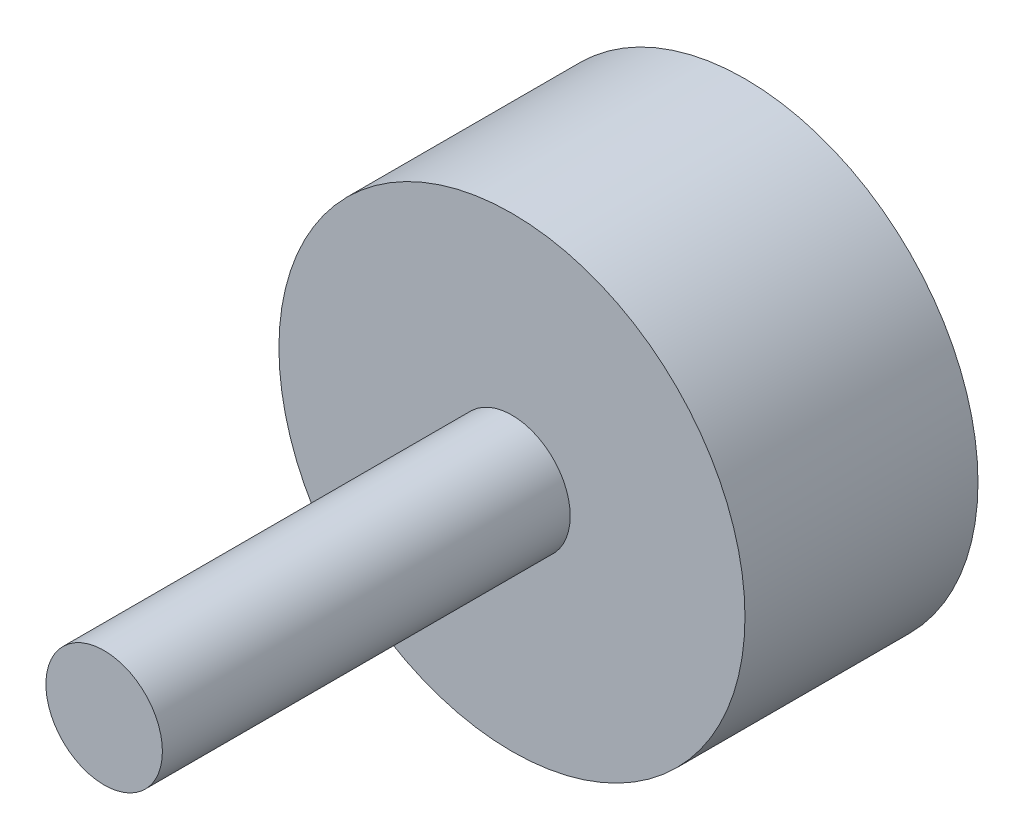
from build123d import *

# Parameters (mm, degrees)
SKETCH1_R           = 12.7
BOSS_EXTRUDE1_DEPTH = 12.7
SKETCH2_R           = 3.175
BOSS_EXTRUDE2_DEPTH = 22.225


with BuildPart() as part:
    # Sketch1 → Boss-Extrude1 (new body)
    with BuildSketch(Plane.XY):
        Circle(SKETCH1_R)
    extrude(amount=BOSS_EXTRUDE1_DEPTH)

    # Sketch2 → Boss-Extrude2 (add)
    with BuildSketch(Plane.XY.offset(12.7)):
        Circle(SKETCH2_R)
    extrude(amount=BOSS_EXTRUDE2_DEPTH)


solid = part.part
